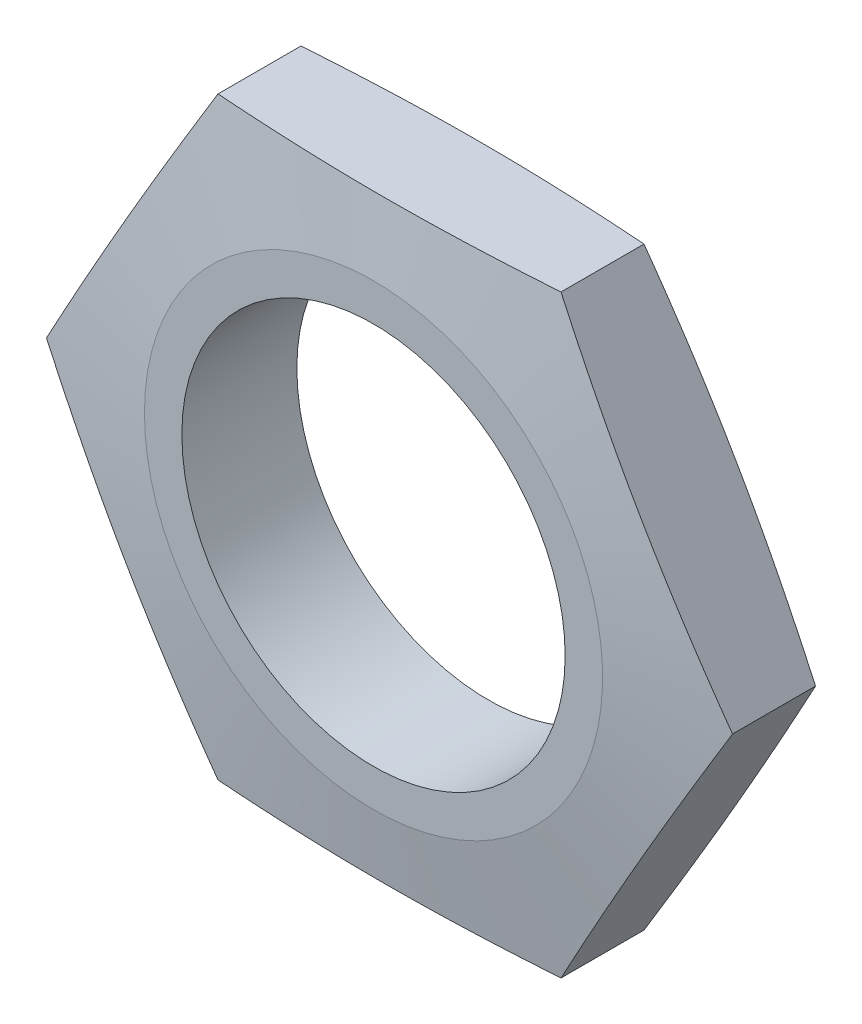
ISO-10303-21;
HEADER;
FILE_DESCRIPTION(('STEP AP214'),'2;1');
FILE_NAME('part.step','',(''),(''),'','','');
FILE_SCHEMA(('AUTOMOTIVE_DESIGN { 1 0 10303 214 1 1 1 1 }'));
ENDSEC;
DATA;
#1=APPLICATION_CONTEXT('core data for automotive mechanical design processes');
#2=APPLICATION_PROTOCOL_DEFINITION('international standard','automotive_design',2000,#1);
#3=PRODUCT_CONTEXT('',#1,'mechanical');
#4=PRODUCT('Part','Part','',(#3));
#5=PRODUCT_RELATED_PRODUCT_CATEGORY('part','',(#4));
#6=PRODUCT_DEFINITION_FORMATION('','',#4);
#7=PRODUCT_DEFINITION_CONTEXT('part definition',#1,'design');
#8=PRODUCT_DEFINITION('design','',#6,#7);
#9=PRODUCT_DEFINITION_SHAPE('','',#8);
#10=(LENGTH_UNIT() NAMED_UNIT(*) SI_UNIT(.MILLI.,.METRE.));
#11=(NAMED_UNIT(*) PLANE_ANGLE_UNIT() SI_UNIT($,.RADIAN.));
#12=(NAMED_UNIT(*) SI_UNIT($,.STERADIAN.) SOLID_ANGLE_UNIT());
#13=UNCERTAINTY_MEASURE_WITH_UNIT(LENGTH_MEASURE(1.E-05),#10,'distance_accuracy_value','');
#14=(GEOMETRIC_REPRESENTATION_CONTEXT(3) GLOBAL_UNCERTAINTY_ASSIGNED_CONTEXT((#13)) GLOBAL_UNIT_ASSIGNED_CONTEXT((#10,
#11,#12)) REPRESENTATION_CONTEXT('',''));
#15=CARTESIAN_POINT('',(0.,0.,0.));
#16=DIRECTION('',(0.,0.,1.));
#17=DIRECTION('',(1.,0.,0.));
#18=AXIS2_PLACEMENT_3D('',#15,#16,#17);
#19=CARTESIAN_POINT('',(-6.81908402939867,-11.811,2.286));
#20=DIRECTION('',(0.,1.,0.));
#21=DIRECTION('',(-1.,0.,0.));
#22=AXIS2_PLACEMENT_3D('',#19,#20,#21);
#23=PLANE('',#22);
#24=CARTESIAN_POINT('',(-17.9839054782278,-11.811,0.543251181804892));
#25=CARTESIAN_POINT('',(-17.4479405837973,-11.811,0.606155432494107));
#26=CARTESIAN_POINT('',(-16.9118795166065,-11.811,0.66825467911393));
#27=CARTESIAN_POINT('',(-15.8395192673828,-11.811,0.790419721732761));
#28=CARTESIAN_POINT('',(-15.303220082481,-11.811,0.850485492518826));
#29=CARTESIAN_POINT('',(-14.2302055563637,-11.811,0.968174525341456));
#30=CARTESIAN_POINT('',(-13.6934901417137,-11.811,1.0257971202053));
#31=CARTESIAN_POINT('',(-12.6197436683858,-11.811,1.13802034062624));
#32=CARTESIAN_POINT('',(-12.0827126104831,-11.811,1.19262097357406));
#33=CARTESIAN_POINT('',(-11.0094197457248,-11.811,1.2979954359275));
#34=CARTESIAN_POINT('',(-10.4731587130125,-11.811,1.34877711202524));
#35=CARTESIAN_POINT('',(-9.40022598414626,-11.811,1.44579113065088));
#36=CARTESIAN_POINT('',(-8.86355429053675,-11.811,1.49202350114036));
#37=CARTESIAN_POINT('',(-7.78977684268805,-11.811,1.57892117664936));
#38=CARTESIAN_POINT('',(-7.25267110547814,-11.811,1.61958669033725));
#39=CARTESIAN_POINT('',(-6.17798771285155,-11.811,1.69418957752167));
#40=CARTESIAN_POINT('',(-5.64041005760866,-11.811,1.72812695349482));
#41=CARTESIAN_POINT('',(-4.56322107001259,-11.811,1.78812640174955));
#42=CARTESIAN_POINT('',(-4.02360841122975,-11.811,1.81416498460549));
#43=CARTESIAN_POINT('',(-2.94401510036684,-11.811,1.85706041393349));
#44=CARTESIAN_POINT('',(-2.40403445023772,-11.811,1.87391730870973));
#45=CARTESIAN_POINT('',(-1.32390944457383,-11.811,1.89756369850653));
#46=CARTESIAN_POINT('',(-0.783765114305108,-11.811,1.90435432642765));
#47=CARTESIAN_POINT('',(0.296554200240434,-11.811,1.90748286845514));
#48=CARTESIAN_POINT('',(0.836729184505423,-11.811,1.90382078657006));
#49=CARTESIAN_POINT('',(1.91744746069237,-11.811,1.8862473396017));
#50=CARTESIAN_POINT('',(2.45799058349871,-11.811,1.87232576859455));
#51=CARTESIAN_POINT('',(3.53874533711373,-11.811,1.83497857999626));
#52=CARTESIAN_POINT('',(4.07895696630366,-11.811,1.81155291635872));
#53=CARTESIAN_POINT('',(5.15902974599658,-11.811,1.75630528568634));
#54=CARTESIAN_POINT('',(5.6988908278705,-11.811,1.72448199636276));
#55=CARTESIAN_POINT('',(6.7781392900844,-11.811,1.65368777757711));
#56=CARTESIAN_POINT('',(7.31752666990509,-11.811,1.61471684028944));
#57=CARTESIAN_POINT('',(8.36923204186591,-11.811,1.53290554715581));
#58=CARTESIAN_POINT('',(8.88157248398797,-11.811,1.49035099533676));
#59=CARTESIAN_POINT('',(9.90586705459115,-11.811,1.40080085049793));
#60=CARTESIAN_POINT('',(10.4178211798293,-11.811,1.3538052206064));
#61=CARTESIAN_POINT('',(11.4413940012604,-11.811,1.25616403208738));
#62=CARTESIAN_POINT('',(11.9530126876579,-11.811,1.20551837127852));
#63=CARTESIAN_POINT('',(12.9759450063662,-11.811,1.10122740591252));
#64=CARTESIAN_POINT('',(13.487258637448,-11.811,1.0475820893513));
#65=CARTESIAN_POINT('',(15.0209069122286,-11.811,0.882963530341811));
#66=CARTESIAN_POINT('',(16.0428469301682,-11.811,0.768317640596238));
#67=CARTESIAN_POINT('',(18.085930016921,-11.811,0.532356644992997));
#68=CARTESIAN_POINT('',(19.1070730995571,-11.811,0.411041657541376));
#69=CARTESIAN_POINT('',(21.1460196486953,-11.811,0.164050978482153));
#70=CARTESIAN_POINT('',(22.1638246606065,-11.811,0.0383880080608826));
#71=CARTESIAN_POINT('',(24.1990173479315,-11.811,-0.216307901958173));
#72=CARTESIAN_POINT('',(25.2164050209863,-11.811,-0.345340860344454));
#73=CARTESIAN_POINT('',(27.2504394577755,-11.811,-0.605835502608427));
#74=CARTESIAN_POINT('',(28.2670863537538,-11.811,-0.737296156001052));
#75=CARTESIAN_POINT('',(30.3001208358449,-11.811,-1.00212800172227));
#76=CARTESIAN_POINT('',(31.3165084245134,-11.811,-1.13549917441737));
#77=CARTESIAN_POINT('',(32.3328063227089,-11.811,-1.26954186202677));
#78=B_SPLINE_CURVE_WITH_KNOTS('',3,(#24,#25,#26,#27,#28,#29,#30,#31,#32,#33,#34,#35,#36,#37,#38,
#39,#40,#41,#42,#43,#44,#45,#46,#47,#48,#49,#50,#51,#52,#53,#54,#55,#56,#57,#58,#59,#60,#61,#62,
#63,#64,#65,#66,#67,#68,#69,#70,#71,#72,#73,#74,#75,#76,#77),.UNSPECIFIED.,.F.,.F.,(4,2,2,2,2,2,
2,2,2,2,2,2,2,2,2,2,2,2,2,2,2,2,2,2,2,2,4),(0.,1.61893298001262,3.2378860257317,4.8572783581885,
6.47666672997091,8.0926313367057,9.70858601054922,11.3244800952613,12.94037358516,
14.5610263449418,16.1816705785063,17.8021324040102,19.4225936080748,21.044668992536,
22.6667522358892,24.2890910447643,25.9114316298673,27.4537228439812,28.9960268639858,
30.5383740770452,32.0807274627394,35.1657416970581,38.2507011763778,41.3272925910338,
44.4039011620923,47.4792325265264,50.5545323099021),.UNSPECIFIED.);
#79=CARTESIAN_POINT('',(-6.81908402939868,-11.811,1.64964364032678));
#80=VERTEX_POINT('',#79);
#81=CARTESIAN_POINT('',(6.81908402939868,-11.811,1.64964364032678));
#82=VERTEX_POINT('',#81);
#83=EDGE_CURVE('E206',#80,#82,#78,.T.);
#84=ORIENTED_EDGE('',*,*,#83,.F.);
#85=DIRECTION('',(0.,0.,-1.));
#86=VECTOR('',#85,1.);
#87=CARTESIAN_POINT('',(-6.81908402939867,-11.811,2.286));
#88=LINE('',#87,#86);
#89=CARTESIAN_POINT('',(-6.81908402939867,-11.811,-1.64964364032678));
#90=VERTEX_POINT('',#89);
#91=EDGE_CURVE('E62',#80,#90,#88,.T.);
#92=ORIENTED_EDGE('',*,*,#91,.T.);
#93=CARTESIAN_POINT('',(-17.9839054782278,-11.811,-0.543251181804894));
#94=CARTESIAN_POINT('',(-17.4479405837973,-11.811,-0.606155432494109));
#95=CARTESIAN_POINT('',(-16.9118795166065,-11.811,-0.668254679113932));
#96=CARTESIAN_POINT('',(-15.8395192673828,-11.811,-0.790419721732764));
#97=CARTESIAN_POINT('',(-15.303220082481,-11.811,-0.850485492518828));
#98=CARTESIAN_POINT('',(-14.2302055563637,-11.811,-0.968174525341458));
#99=CARTESIAN_POINT('',(-13.6934901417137,-11.811,-1.02579712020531));
#100=CARTESIAN_POINT('',(-12.6197436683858,-11.811,-1.13802034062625));
#101=CARTESIAN_POINT('',(-12.0827126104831,-11.811,-1.19262097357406));
#102=CARTESIAN_POINT('',(-11.0094197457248,-11.811,-1.2979954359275));
#103=CARTESIAN_POINT('',(-10.4731587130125,-11.811,-1.34877711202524));
#104=CARTESIAN_POINT('',(-9.40022598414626,-11.811,-1.44579113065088));
#105=CARTESIAN_POINT('',(-8.86355429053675,-11.811,-1.49202350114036));
#106=CARTESIAN_POINT('',(-7.78977684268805,-11.811,-1.57892117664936));
#107=CARTESIAN_POINT('',(-7.25267110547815,-11.811,-1.61958669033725));
#108=CARTESIAN_POINT('',(-6.17798771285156,-11.811,-1.69418957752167));
#109=CARTESIAN_POINT('',(-5.64041005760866,-11.811,-1.72812695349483));
#110=CARTESIAN_POINT('',(-4.56322107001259,-11.811,-1.78812640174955));
#111=CARTESIAN_POINT('',(-4.02360841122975,-11.811,-1.81416498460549));
#112=CARTESIAN_POINT('',(-2.94401510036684,-11.811,-1.85706041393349));
#113=CARTESIAN_POINT('',(-2.40403445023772,-11.811,-1.87391730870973));
#114=CARTESIAN_POINT('',(-1.32390944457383,-11.811,-1.89756369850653));
#115=CARTESIAN_POINT('',(-0.783765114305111,-11.811,-1.90435432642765));
#116=CARTESIAN_POINT('',(0.29655420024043,-11.811,-1.90748286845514));
#117=CARTESIAN_POINT('',(0.836729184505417,-11.811,-1.90382078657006));
#118=CARTESIAN_POINT('',(1.91744746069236,-11.811,-1.8862473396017));
#119=CARTESIAN_POINT('',(2.4579905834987,-11.811,-1.87232576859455));
#120=CARTESIAN_POINT('',(3.53874533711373,-11.811,-1.83497857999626));
#121=CARTESIAN_POINT('',(4.07895696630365,-11.811,-1.81155291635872));
#122=CARTESIAN_POINT('',(5.15902974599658,-11.811,-1.75630528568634));
#123=CARTESIAN_POINT('',(5.6988908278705,-11.811,-1.72448199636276));
#124=CARTESIAN_POINT('',(6.7781392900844,-11.811,-1.65368777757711));
#125=CARTESIAN_POINT('',(7.31752666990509,-11.811,-1.61471684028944));
#126=CARTESIAN_POINT('',(8.36923204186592,-11.811,-1.53290554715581));
#127=CARTESIAN_POINT('',(8.88157248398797,-11.811,-1.49035099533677));
#128=CARTESIAN_POINT('',(9.90586705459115,-11.811,-1.40080085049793));
#129=CARTESIAN_POINT('',(10.4178211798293,-11.811,-1.35380522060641));
#130=CARTESIAN_POINT('',(11.4413940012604,-11.811,-1.25616403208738));
#131=CARTESIAN_POINT('',(11.9530126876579,-11.811,-1.20551837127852));
#132=CARTESIAN_POINT('',(12.9759450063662,-11.811,-1.10122740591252));
#133=CARTESIAN_POINT('',(13.487258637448,-11.811,-1.0475820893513));
#134=CARTESIAN_POINT('',(15.0209069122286,-11.811,-0.882963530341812));
#135=CARTESIAN_POINT('',(16.0428469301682,-11.811,-0.768317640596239));
#136=CARTESIAN_POINT('',(18.085930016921,-11.811,-0.532356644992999));
#137=CARTESIAN_POINT('',(19.1070730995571,-11.811,-0.411041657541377));
#138=CARTESIAN_POINT('',(21.1460196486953,-11.811,-0.164050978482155));
#139=CARTESIAN_POINT('',(22.1638246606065,-11.811,-0.0383880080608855));
#140=CARTESIAN_POINT('',(24.1990173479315,-11.811,0.216307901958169));
#141=CARTESIAN_POINT('',(25.2164050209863,-11.811,0.34534086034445));
#142=CARTESIAN_POINT('',(27.2504394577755,-11.811,0.605835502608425));
#143=CARTESIAN_POINT('',(28.2670863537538,-11.811,0.73729615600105));
#144=CARTESIAN_POINT('',(30.3001208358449,-11.811,1.00212800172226));
#145=CARTESIAN_POINT('',(31.3165084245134,-11.811,1.13549917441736));
#146=CARTESIAN_POINT('',(32.3328063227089,-11.811,1.26954186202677));
#147=B_SPLINE_CURVE_WITH_KNOTS('',3,(#93,#94,#95,#96,#97,#98,#99,#100,#101,#102,#103,#104,#105,
#106,#107,#108,#109,#110,#111,#112,#113,#114,#115,#116,#117,#118,#119,#120,#121,#122,#123,#124,
#125,#126,#127,#128,#129,#130,#131,#132,#133,#134,#135,#136,#137,#138,#139,#140,#141,#142,#143,
#144,#145,#146),.UNSPECIFIED.,.F.,.F.,(4,2,2,2,2,2,2,2,2,2,2,2,2,2,2,2,2,2,2,2,2,2,2,2,2,2,4),
(0.,1.61893298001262,3.23788602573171,4.8572783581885,6.47666672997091,8.0926313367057,
9.70858601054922,11.3244800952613,12.94037358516,14.5610263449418,16.1816705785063,
17.8021324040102,19.4225936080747,21.044668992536,22.6667522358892,24.2890910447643,
25.9114316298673,27.4537228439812,28.9960268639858,30.5383740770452,32.0807274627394,
35.1657416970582,38.2507011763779,41.3272925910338,44.4039011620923,47.4792325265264,
50.5545323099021),.UNSPECIFIED.);
#148=CARTESIAN_POINT('',(6.81908402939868,-11.811,-1.64964364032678));
#149=VERTEX_POINT('',#148);
#150=EDGE_CURVE('E132',#149,#90,#147,.F.);
#151=ORIENTED_EDGE('',*,*,#150,.F.);
#152=DIRECTION('',(0.,0.,-1.));
#153=VECTOR('',#152,1.);
#154=CARTESIAN_POINT('',(6.81908402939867,-11.811,2.286));
#155=LINE('',#154,#153);
#156=EDGE_CURVE('E47',#82,#149,#155,.T.);
#157=ORIENTED_EDGE('',*,*,#156,.F.);
#158=EDGE_LOOP('',(#84,#92,#151,#157));
#159=FACE_BOUND('',#158,.T.);
#160=ADVANCED_FACE('F33',(#159),#23,.F.);
#161=CARTESIAN_POINT('',(6.81908402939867,-11.811,2.286));
#162=DIRECTION('',(-0.866025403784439,0.5,0.));
#163=DIRECTION('',(-0.5,-0.866025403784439,0.));
#164=AXIS2_PLACEMENT_3D('',#161,#162,#163);
#165=PLANE('',#164);
#166=CARTESIAN_POINT('',(6.81896855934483,-11.8112,1.64962742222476));
#167=CARTESIAN_POINT('',(7.10284384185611,-11.3195135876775,1.68951553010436));
#168=CARTESIAN_POINT('',(7.38686229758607,-10.827579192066,1.72566335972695));
#169=CARTESIAN_POINT('',(7.95517530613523,-9.84323218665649,1.7890958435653));
#170=CARTESIAN_POINT('',(8.239469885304,-9.35081953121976,1.81637954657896));
#171=CARTESIAN_POINT('',(8.80785826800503,-8.36634197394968,1.86066039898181));
#172=CARTESIAN_POINT('',(9.0919517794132,-7.87427757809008,1.87767216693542));
#173=CARTESIAN_POINT('',(9.66023887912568,-6.88997544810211,1.90047738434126));
#174=CARTESIAN_POINT('',(9.94443246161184,-6.39773772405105,1.90627140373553));
#175=CARTESIAN_POINT('',(10.5128196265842,-5.41326227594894,1.90627140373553));
#176=CARTESIAN_POINT('',(10.7970132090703,-4.92102455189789,1.90047738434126));
#177=CARTESIAN_POINT('',(11.3653003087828,-3.93672242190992,1.87767216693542));
#178=CARTESIAN_POINT('',(11.649393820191,-3.44465802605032,1.86066039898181));
#179=CARTESIAN_POINT('',(12.217782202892,-2.46018046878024,1.81637954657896));
#180=CARTESIAN_POINT('',(12.5020767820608,-1.96776781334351,1.7890958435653));
#181=CARTESIAN_POINT('',(13.0703897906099,-0.983420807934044,1.72566335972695));
#182=CARTESIAN_POINT('',(13.3544082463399,-0.491486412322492,1.68951553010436));
#183=CARTESIAN_POINT('',(13.6382835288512,0.000200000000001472,1.64962742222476));
#184=B_SPLINE_CURVE_WITH_KNOTS('',3,(#166,#167,#168,#169,#170,#171,#172,#173,#174,#175,#176,
#177,#178,#179,#180,#181,#182,#183),.UNSPECIFIED.,.F.,.F.,(4,2,2,2,2,2,2,2,4),(0.,
1.70747320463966,3.41512957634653,5.12034992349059,6.82548363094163,8.53061733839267,
10.2358376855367,11.9434940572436,13.6509672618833),.UNSPECIFIED.);
#185=CARTESIAN_POINT('',(13.6381680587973,0.,1.64964364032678));
#186=VERTEX_POINT('',#185);
#187=EDGE_CURVE('E128',#82,#186,#184,.T.);
#188=ORIENTED_EDGE('',*,*,#187,.F.);
#189=ORIENTED_EDGE('',*,*,#156,.T.);
#190=CARTESIAN_POINT('',(13.6382835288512,0.000200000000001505,-1.64962742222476));
#191=CARTESIAN_POINT('',(13.3544082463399,-0.491486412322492,-1.68951553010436));
#192=CARTESIAN_POINT('',(13.0703897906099,-0.983420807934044,-1.72566335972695));
#193=CARTESIAN_POINT('',(12.5020767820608,-1.96776781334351,-1.7890958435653));
#194=CARTESIAN_POINT('',(12.217782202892,-2.46018046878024,-1.81637954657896));
#195=CARTESIAN_POINT('',(11.649393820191,-3.44465802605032,-1.86066039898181));
#196=CARTESIAN_POINT('',(11.3653003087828,-3.93672242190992,-1.87767216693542));
#197=CARTESIAN_POINT('',(10.7970132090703,-4.92102455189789,-1.90047738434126));
#198=CARTESIAN_POINT('',(10.5128196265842,-5.41326227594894,-1.90627140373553));
#199=CARTESIAN_POINT('',(9.94443246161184,-6.39773772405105,-1.90627140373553));
#200=CARTESIAN_POINT('',(9.66023887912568,-6.88997544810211,-1.90047738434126));
#201=CARTESIAN_POINT('',(9.0919517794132,-7.87427757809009,-1.87767216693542));
#202=CARTESIAN_POINT('',(8.80785826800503,-8.36634197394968,-1.86066039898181));
#203=CARTESIAN_POINT('',(8.239469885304,-9.35081953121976,-1.81637954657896));
#204=CARTESIAN_POINT('',(7.95517530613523,-9.8432321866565,-1.7890958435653));
#205=CARTESIAN_POINT('',(7.38686229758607,-10.827579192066,-1.72566335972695));
#206=CARTESIAN_POINT('',(7.10284384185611,-11.3195135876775,-1.68951553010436));
#207=CARTESIAN_POINT('',(6.81896855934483,-11.8112,-1.64962742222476));
#208=B_SPLINE_CURVE_WITH_KNOTS('',3,(#190,#191,#192,#193,#194,#195,#196,#197,#198,#199,#200,
#201,#202,#203,#204,#205,#206,#207),.UNSPECIFIED.,.F.,.F.,(4,2,2,2,2,2,2,2,4),(0.,
1.70747320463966,3.41512957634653,5.12034992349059,6.82548363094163,8.53061733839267,
10.2358376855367,11.9434940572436,13.6509672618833),.UNSPECIFIED.);
#209=CARTESIAN_POINT('',(13.6381680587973,0.,-1.64964364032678));
#210=VERTEX_POINT('',#209);
#211=EDGE_CURVE('E127',#210,#149,#208,.T.);
#212=ORIENTED_EDGE('',*,*,#211,.F.);
#213=DIRECTION('',(0.,0.,-1.));
#214=VECTOR('',#213,1.);
#215=CARTESIAN_POINT('',(13.6381680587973,0.,2.286));
#216=LINE('',#215,#214);
#217=EDGE_CURVE('E115',#186,#210,#216,.T.);
#218=ORIENTED_EDGE('',*,*,#217,.F.);
#219=EDGE_LOOP('',(#188,#189,#212,#218));
#220=FACE_BOUND('',#219,.T.);
#221=ADVANCED_FACE('F125',(#220),#165,.F.);
#222=CARTESIAN_POINT('',(13.6381680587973,0.,2.286));
#223=DIRECTION('',(-0.866025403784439,-0.5,0.));
#224=DIRECTION('',(0.5,-0.866025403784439,0.));
#225=AXIS2_PLACEMENT_3D('',#222,#223,#224);
#226=PLANE('',#225);
#227=CARTESIAN_POINT('',(13.6382835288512,-0.000199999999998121,1.64962742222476));
#228=CARTESIAN_POINT('',(13.3544082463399,0.491486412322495,1.68951553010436));
#229=CARTESIAN_POINT('',(13.0703897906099,0.983420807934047,1.72566335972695));
#230=CARTESIAN_POINT('',(12.5020767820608,1.96776781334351,1.7890958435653));
#231=CARTESIAN_POINT('',(12.217782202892,2.46018046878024,1.81637954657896));
#232=CARTESIAN_POINT('',(11.649393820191,3.44465802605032,1.86066039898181));
#233=CARTESIAN_POINT('',(11.3653003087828,3.93672242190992,1.87767216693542));
#234=CARTESIAN_POINT('',(10.7970132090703,4.92102455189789,1.90047738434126));
#235=CARTESIAN_POINT('',(10.5128196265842,5.41326227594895,1.90627140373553));
#236=CARTESIAN_POINT('',(9.94443246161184,6.39773772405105,1.90627140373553));
#237=CARTESIAN_POINT('',(9.66023887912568,6.88997544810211,1.90047738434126));
#238=CARTESIAN_POINT('',(9.0919517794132,7.87427757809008,1.87767216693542));
#239=CARTESIAN_POINT('',(8.80785826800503,8.36634197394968,1.86066039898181));
#240=CARTESIAN_POINT('',(8.239469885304,9.35081953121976,1.81637954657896));
#241=CARTESIAN_POINT('',(7.95517530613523,9.84323218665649,1.7890958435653));
#242=CARTESIAN_POINT('',(7.38686229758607,10.827579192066,1.72566335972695));
#243=CARTESIAN_POINT('',(7.10284384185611,11.3195135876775,1.68951553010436));
#244=CARTESIAN_POINT('',(6.81896855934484,11.8112,1.64962742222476));
#245=B_SPLINE_CURVE_WITH_KNOTS('',3,(#227,#228,#229,#230,#231,#232,#233,#234,#235,#236,#237,
#238,#239,#240,#241,#242,#243,#244),.UNSPECIFIED.,.F.,.F.,(4,2,2,2,2,2,2,2,4),(0.,
1.70747320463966,3.41512957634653,5.12034992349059,6.82548363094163,8.53061733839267,
10.2358376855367,11.9434940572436,13.6509672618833),.UNSPECIFIED.);
#246=CARTESIAN_POINT('',(6.81908402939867,11.811,1.64964364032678));
#247=VERTEX_POINT('',#246);
#248=EDGE_CURVE('E95',#186,#247,#245,.T.);
#249=ORIENTED_EDGE('',*,*,#248,.F.);
#250=ORIENTED_EDGE('',*,*,#217,.T.);
#251=CARTESIAN_POINT('',(6.81896855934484,11.8112,-1.64962742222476));
#252=CARTESIAN_POINT('',(7.10284384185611,11.3195135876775,-1.68951553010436));
#253=CARTESIAN_POINT('',(7.38686229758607,10.827579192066,-1.72566335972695));
#254=CARTESIAN_POINT('',(7.95517530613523,9.84323218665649,-1.7890958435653));
#255=CARTESIAN_POINT('',(8.239469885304,9.35081953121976,-1.81637954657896));
#256=CARTESIAN_POINT('',(8.80785826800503,8.36634197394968,-1.86066039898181));
#257=CARTESIAN_POINT('',(9.0919517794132,7.87427757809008,-1.87767216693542));
#258=CARTESIAN_POINT('',(9.66023887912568,6.88997544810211,-1.90047738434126));
#259=CARTESIAN_POINT('',(9.94443246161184,6.39773772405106,-1.90627140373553));
#260=CARTESIAN_POINT('',(10.5128196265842,5.41326227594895,-1.90627140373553));
#261=CARTESIAN_POINT('',(10.7970132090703,4.92102455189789,-1.90047738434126));
#262=CARTESIAN_POINT('',(11.3653003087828,3.93672242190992,-1.87767216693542));
#263=CARTESIAN_POINT('',(11.649393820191,3.44465802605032,-1.86066039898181));
#264=CARTESIAN_POINT('',(12.217782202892,2.46018046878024,-1.81637954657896));
#265=CARTESIAN_POINT('',(12.5020767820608,1.96776781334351,-1.7890958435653));
#266=CARTESIAN_POINT('',(13.0703897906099,0.983420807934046,-1.72566335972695));
#267=CARTESIAN_POINT('',(13.3544082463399,0.491486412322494,-1.68951553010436));
#268=CARTESIAN_POINT('',(13.6382835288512,-0.000199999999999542,-1.64962742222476));
#269=B_SPLINE_CURVE_WITH_KNOTS('',3,(#251,#252,#253,#254,#255,#256,#257,#258,#259,#260,#261,
#262,#263,#264,#265,#266,#267,#268),.UNSPECIFIED.,.F.,.F.,(4,2,2,2,2,2,2,2,4),(0.,
1.70747320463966,3.41512957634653,5.12034992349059,6.82548363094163,8.53061733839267,
10.2358376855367,11.9434940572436,13.6509672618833),.UNSPECIFIED.);
#270=CARTESIAN_POINT('',(6.81908402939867,11.811,-1.64964364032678));
#271=VERTEX_POINT('',#270);
#272=EDGE_CURVE('E135',#271,#210,#269,.T.);
#273=ORIENTED_EDGE('',*,*,#272,.F.);
#274=DIRECTION('',(0.,0.,-1.));
#275=VECTOR('',#274,1.);
#276=CARTESIAN_POINT('',(6.81908402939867,11.811,2.286));
#277=LINE('',#276,#275);
#278=EDGE_CURVE('E113',#247,#271,#277,.T.);
#279=ORIENTED_EDGE('',*,*,#278,.F.);
#280=EDGE_LOOP('',(#249,#250,#273,#279));
#281=FACE_BOUND('',#280,.T.);
#282=ADVANCED_FACE('F184',(#281),#226,.F.);
#283=CARTESIAN_POINT('',(6.81908402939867,11.811,2.286));
#284=DIRECTION('',(0.,-1.,0.));
#285=DIRECTION('',(0.,0.,-1.));
#286=AXIS2_PLACEMENT_3D('',#283,#284,#285);
#287=PLANE('',#286);
#288=CARTESIAN_POINT('',(-17.9839054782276,11.811,0.543251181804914));
#289=CARTESIAN_POINT('',(-17.4479405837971,11.811,0.606155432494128));
#290=CARTESIAN_POINT('',(-16.9118795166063,11.811,0.668254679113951));
#291=CARTESIAN_POINT('',(-15.8395192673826,11.811,0.790419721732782));
#292=CARTESIAN_POINT('',(-15.3032200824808,11.811,0.850485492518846));
#293=CARTESIAN_POINT('',(-14.2302055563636,11.811,0.968174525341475));
#294=CARTESIAN_POINT('',(-13.6934901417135,11.811,1.02579712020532));
#295=CARTESIAN_POINT('',(-12.6197436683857,11.811,1.13802034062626));
#296=CARTESIAN_POINT('',(-12.082712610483,11.811,1.19262097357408));
#297=CARTESIAN_POINT('',(-11.0094197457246,11.811,1.29799543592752));
#298=CARTESIAN_POINT('',(-10.4731587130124,11.811,1.34877711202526));
#299=CARTESIAN_POINT('',(-9.40022598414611,11.811,1.44579113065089));
#300=CARTESIAN_POINT('',(-8.8635542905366,11.811,1.49202350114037));
#301=CARTESIAN_POINT('',(-7.78977684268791,11.811,1.57892117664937));
#302=CARTESIAN_POINT('',(-7.252671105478,11.811,1.61958669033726));
#303=CARTESIAN_POINT('',(-6.17798771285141,11.811,1.69418957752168));
#304=CARTESIAN_POINT('',(-5.64041005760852,11.811,1.72812695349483));
#305=CARTESIAN_POINT('',(-4.56322107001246,11.811,1.78812640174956));
#306=CARTESIAN_POINT('',(-4.02360841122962,11.811,1.8141649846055));
#307=CARTESIAN_POINT('',(-2.94401510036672,11.811,1.85706041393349));
#308=CARTESIAN_POINT('',(-2.4040344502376,11.811,1.87391730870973));
#309=CARTESIAN_POINT('',(-1.32390944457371,11.811,1.89756369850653));
#310=CARTESIAN_POINT('',(-0.783765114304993,11.811,1.90435432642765));
#311=CARTESIAN_POINT('',(0.296554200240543,11.811,1.90748286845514));
#312=CARTESIAN_POINT('',(0.836729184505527,11.811,1.90382078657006));
#313=CARTESIAN_POINT('',(1.91744746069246,11.811,1.8862473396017));
#314=CARTESIAN_POINT('',(2.45799058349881,11.811,1.87232576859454));
#315=CARTESIAN_POINT('',(3.53874533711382,11.811,1.83497857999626));
#316=CARTESIAN_POINT('',(4.07895696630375,11.811,1.81155291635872));
#317=CARTESIAN_POINT('',(5.15902974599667,11.811,1.75630528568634));
#318=CARTESIAN_POINT('',(5.69889082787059,11.811,1.72448199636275));
#319=CARTESIAN_POINT('',(6.77813929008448,11.811,1.6536877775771));
#320=CARTESIAN_POINT('',(7.31752666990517,11.811,1.61471684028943));
#321=CARTESIAN_POINT('',(8.36923204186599,11.811,1.53290554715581));
#322=CARTESIAN_POINT('',(8.88157248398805,11.811,1.49035099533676));
#323=CARTESIAN_POINT('',(9.90586705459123,11.811,1.40080085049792));
#324=CARTESIAN_POINT('',(10.4178211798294,11.811,1.3538052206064));
#325=CARTESIAN_POINT('',(11.4413940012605,11.811,1.25616403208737));
#326=CARTESIAN_POINT('',(11.953012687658,11.811,1.20551837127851));
#327=CARTESIAN_POINT('',(12.9759450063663,11.811,1.10122740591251));
#328=CARTESIAN_POINT('',(13.4872586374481,11.811,1.04758208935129));
#329=CARTESIAN_POINT('',(15.0209069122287,11.811,0.8829635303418));
#330=CARTESIAN_POINT('',(16.0428469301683,11.811,0.768317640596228));
#331=CARTESIAN_POINT('',(18.0859300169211,11.811,0.532356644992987));
#332=CARTESIAN_POINT('',(19.1070730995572,11.811,0.411041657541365));
#333=CARTESIAN_POINT('',(21.1460196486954,11.811,0.164050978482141));
#334=CARTESIAN_POINT('',(22.1638246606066,11.811,0.0383880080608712));
#335=CARTESIAN_POINT('',(24.1990173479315,11.811,-0.216307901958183));
#336=CARTESIAN_POINT('',(25.2164050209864,11.811,-0.345340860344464));
#337=CARTESIAN_POINT('',(27.2504394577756,11.811,-0.605835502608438));
#338=CARTESIAN_POINT('',(28.2670863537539,11.811,-0.737296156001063));
#339=CARTESIAN_POINT('',(30.300120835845,11.811,-1.00212800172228));
#340=CARTESIAN_POINT('',(31.3165084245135,11.811,-1.13549917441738));
#341=CARTESIAN_POINT('',(32.332806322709,11.811,-1.26954186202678));
#342=B_SPLINE_CURVE_WITH_KNOTS('',3,(#288,#289,#290,#291,#292,#293,#294,#295,#296,#297,#298,
#299,#300,#301,#302,#303,#304,#305,#306,#307,#308,#309,#310,#311,#312,#313,#314,#315,#316,#317,
#318,#319,#320,#321,#322,#323,#324,#325,#326,#327,#328,#329,#330,#331,#332,#333,#334,#335,#336,
#337,#338,#339,#340,#341),.UNSPECIFIED.,.F.,.F.,(4,2,2,2,2,2,2,2,2,2,2,2,2,2,2,2,2,2,2,2,2,2,2,
2,2,2,4),(0.,1.61893298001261,3.23788602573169,4.85727835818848,6.47666672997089,
8.09263133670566,9.70858601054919,11.3244800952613,12.9403735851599,14.5610263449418,
16.1816705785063,17.8021324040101,19.4225936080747,21.0446689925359,22.6667522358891,
24.2890910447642,25.9114316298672,27.4537228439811,28.9960268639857,30.5383740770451,
32.0807274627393,35.1657416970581,38.2507011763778,41.3272925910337,44.4039011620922,
47.4792325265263,50.554532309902),.UNSPECIFIED.);
#343=CARTESIAN_POINT('',(-6.81908402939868,11.811,1.64964364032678));
#344=VERTEX_POINT('',#343);
#345=EDGE_CURVE('E92',#247,#344,#342,.F.);
#346=ORIENTED_EDGE('',*,*,#345,.F.);
#347=ORIENTED_EDGE('',*,*,#278,.T.);
#348=CARTESIAN_POINT('',(-17.9839054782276,11.811,-0.543251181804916));
#349=CARTESIAN_POINT('',(-17.4479405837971,11.811,-0.60615543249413));
#350=CARTESIAN_POINT('',(-16.9118795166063,11.811,-0.668254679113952));
#351=CARTESIAN_POINT('',(-15.8395192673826,11.811,-0.790419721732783));
#352=CARTESIAN_POINT('',(-15.3032200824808,11.811,-0.850485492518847));
#353=CARTESIAN_POINT('',(-14.2302055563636,11.811,-0.968174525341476));
#354=CARTESIAN_POINT('',(-13.6934901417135,11.811,-1.02579712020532));
#355=CARTESIAN_POINT('',(-12.6197436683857,11.811,-1.13802034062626));
#356=CARTESIAN_POINT('',(-12.082712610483,11.811,-1.19262097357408));
#357=CARTESIAN_POINT('',(-11.0094197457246,11.811,-1.29799543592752));
#358=CARTESIAN_POINT('',(-10.4731587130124,11.811,-1.34877711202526));
#359=CARTESIAN_POINT('',(-9.40022598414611,11.811,-1.44579113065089));
#360=CARTESIAN_POINT('',(-8.86355429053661,11.811,-1.49202350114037));
#361=CARTESIAN_POINT('',(-7.78977684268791,11.811,-1.57892117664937));
#362=CARTESIAN_POINT('',(-7.252671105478,11.811,-1.61958669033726));
#363=CARTESIAN_POINT('',(-6.17798771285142,11.811,-1.69418957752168));
#364=CARTESIAN_POINT('',(-5.64041005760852,11.811,-1.72812695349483));
#365=CARTESIAN_POINT('',(-4.56322107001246,11.811,-1.78812640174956));
#366=CARTESIAN_POINT('',(-4.02360841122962,11.811,-1.8141649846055));
#367=CARTESIAN_POINT('',(-2.94401510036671,11.811,-1.85706041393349));
#368=CARTESIAN_POINT('',(-2.40403445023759,11.811,-1.87391730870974));
#369=CARTESIAN_POINT('',(-1.32390944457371,11.811,-1.89756369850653));
#370=CARTESIAN_POINT('',(-0.78376511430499,11.811,-1.90435432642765));
#371=CARTESIAN_POINT('',(0.296554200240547,11.811,-1.90748286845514));
#372=CARTESIAN_POINT('',(0.836729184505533,11.811,-1.90382078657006));
#373=CARTESIAN_POINT('',(1.91744746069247,11.811,-1.8862473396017));
#374=CARTESIAN_POINT('',(2.45799058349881,11.811,-1.87232576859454));
#375=CARTESIAN_POINT('',(3.53874533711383,11.811,-1.83497857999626));
#376=CARTESIAN_POINT('',(4.07895696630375,11.811,-1.81155291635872));
#377=CARTESIAN_POINT('',(5.15902974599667,11.811,-1.75630528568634));
#378=CARTESIAN_POINT('',(5.69889082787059,11.811,-1.72448199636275));
#379=CARTESIAN_POINT('',(6.77813929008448,11.811,-1.6536877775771));
#380=CARTESIAN_POINT('',(7.31752666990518,11.811,-1.61471684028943));
#381=CARTESIAN_POINT('',(8.369232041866,11.811,-1.53290554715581));
#382=CARTESIAN_POINT('',(8.88157248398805,11.811,-1.49035099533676));
#383=CARTESIAN_POINT('',(9.90586705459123,11.811,-1.40080085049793));
#384=CARTESIAN_POINT('',(10.4178211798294,11.811,-1.3538052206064));
#385=CARTESIAN_POINT('',(11.4413940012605,11.811,-1.25616403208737));
#386=CARTESIAN_POINT('',(11.953012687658,11.811,-1.20551837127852));
#387=CARTESIAN_POINT('',(12.9759450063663,11.811,-1.10122740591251));
#388=CARTESIAN_POINT('',(13.4872586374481,11.811,-1.04758208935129));
#389=CARTESIAN_POINT('',(15.0209069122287,11.811,-0.882963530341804));
#390=CARTESIAN_POINT('',(16.0428469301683,11.811,-0.768317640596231));
#391=CARTESIAN_POINT('',(18.0859300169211,11.811,-0.532356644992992));
#392=CARTESIAN_POINT('',(19.1070730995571,11.811,-0.41104165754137));
#393=CARTESIAN_POINT('',(21.1460196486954,11.811,-0.164050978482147));
#394=CARTESIAN_POINT('',(22.1638246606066,11.811,-0.0383880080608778));
#395=CARTESIAN_POINT('',(24.1990173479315,11.811,0.216307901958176));
#396=CARTESIAN_POINT('',(25.2164050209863,11.811,0.345340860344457));
#397=CARTESIAN_POINT('',(27.2504394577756,11.811,0.605835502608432));
#398=CARTESIAN_POINT('',(28.2670863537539,11.811,0.737296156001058));
#399=CARTESIAN_POINT('',(30.300120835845,11.811,1.00212800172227));
#400=CARTESIAN_POINT('',(31.3165084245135,11.811,1.13549917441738));
#401=CARTESIAN_POINT('',(32.332806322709,11.811,1.26954186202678));
#402=B_SPLINE_CURVE_WITH_KNOTS('',3,(#348,#349,#350,#351,#352,#353,#354,#355,#356,#357,#358,
#359,#360,#361,#362,#363,#364,#365,#366,#367,#368,#369,#370,#371,#372,#373,#374,#375,#376,#377,
#378,#379,#380,#381,#382,#383,#384,#385,#386,#387,#388,#389,#390,#391,#392,#393,#394,#395,#396,
#397,#398,#399,#400,#401),.UNSPECIFIED.,.F.,.F.,(4,2,2,2,2,2,2,2,2,2,2,2,2,2,2,2,2,2,2,2,2,2,2,
2,2,2,4),(0.,1.61893298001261,3.23788602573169,4.85727835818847,6.47666672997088,
8.09263133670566,9.70858601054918,11.3244800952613,12.9403735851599,14.5610263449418,
16.1816705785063,17.8021324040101,19.4225936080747,21.0446689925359,22.6667522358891,
24.2890910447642,25.9114316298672,27.4537228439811,28.9960268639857,30.5383740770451,
32.0807274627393,35.165741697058,38.2507011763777,41.3272925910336,44.4039011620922,
47.4792325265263,50.554532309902),.UNSPECIFIED.);
#403=CARTESIAN_POINT('',(-6.81908402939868,11.811,-1.64964364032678));
#404=VERTEX_POINT('',#403);
#405=EDGE_CURVE('E112',#404,#271,#402,.T.);
#406=ORIENTED_EDGE('',*,*,#405,.F.);
#407=DIRECTION('',(0.,0.,-1.));
#408=VECTOR('',#407,1.);
#409=CARTESIAN_POINT('',(-6.81908402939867,11.811,2.286));
#410=LINE('',#409,#408);
#411=EDGE_CURVE('E104',#344,#404,#410,.T.);
#412=ORIENTED_EDGE('',*,*,#411,.F.);
#413=EDGE_LOOP('',(#346,#347,#406,#412));
#414=FACE_BOUND('',#413,.T.);
#415=ADVANCED_FACE('F110',(#414),#287,.F.);
#416=CARTESIAN_POINT('',(-6.81908402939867,11.811,2.286));
#417=DIRECTION('',(0.866025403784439,-0.5,0.));
#418=DIRECTION('',(0.5,0.866025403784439,0.));
#419=AXIS2_PLACEMENT_3D('',#416,#417,#418);
#420=PLANE('',#419);
#421=CARTESIAN_POINT('',(-6.81896855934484,11.8112,1.64962742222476));
#422=CARTESIAN_POINT('',(-7.10284384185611,11.3195135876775,1.68951553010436));
#423=CARTESIAN_POINT('',(-7.38686229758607,10.827579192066,1.72566335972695));
#424=CARTESIAN_POINT('',(-7.95517530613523,9.8432321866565,1.7890958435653));
#425=CARTESIAN_POINT('',(-8.239469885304,9.35081953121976,1.81637954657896));
#426=CARTESIAN_POINT('',(-8.80785826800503,8.36634197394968,1.86066039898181));
#427=CARTESIAN_POINT('',(-9.0919517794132,7.87427757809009,1.87767216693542));
#428=CARTESIAN_POINT('',(-9.66023887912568,6.88997544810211,1.90047738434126));
#429=CARTESIAN_POINT('',(-9.94443246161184,6.39773772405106,1.90627140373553));
#430=CARTESIAN_POINT('',(-10.5128196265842,5.41326227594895,1.90627140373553));
#431=CARTESIAN_POINT('',(-10.7970132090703,4.92102455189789,1.90047738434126));
#432=CARTESIAN_POINT('',(-11.3653003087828,3.93672242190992,1.87767216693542));
#433=CARTESIAN_POINT('',(-11.649393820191,3.44465802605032,1.86066039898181));
#434=CARTESIAN_POINT('',(-12.217782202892,2.46018046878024,1.81637954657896));
#435=CARTESIAN_POINT('',(-12.5020767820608,1.96776781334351,1.7890958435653));
#436=CARTESIAN_POINT('',(-13.0703897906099,0.983420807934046,1.72566335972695));
#437=CARTESIAN_POINT('',(-13.3544082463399,0.491486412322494,1.68951553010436));
#438=CARTESIAN_POINT('',(-13.6382835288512,-0.000199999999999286,1.64962742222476));
#439=B_SPLINE_CURVE_WITH_KNOTS('',3,(#421,#422,#423,#424,#425,#426,#427,#428,#429,#430,#431,
#432,#433,#434,#435,#436,#437,#438),.UNSPECIFIED.,.F.,.F.,(4,2,2,2,2,2,2,2,4),(0.,
1.70747320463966,3.41512957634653,5.12034992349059,6.82548363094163,8.53061733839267,
10.2358376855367,11.9434940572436,13.6509672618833),.UNSPECIFIED.);
#440=CARTESIAN_POINT('',(-13.6381680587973,0.,1.64964364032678));
#441=VERTEX_POINT('',#440);
#442=EDGE_CURVE('E54',#344,#441,#439,.T.);
#443=ORIENTED_EDGE('',*,*,#442,.F.);
#444=ORIENTED_EDGE('',*,*,#411,.T.);
#445=CARTESIAN_POINT('',(-13.6382835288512,-0.000199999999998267,-1.64962742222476));
#446=CARTESIAN_POINT('',(-13.3544082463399,0.491486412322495,-1.68951553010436));
#447=CARTESIAN_POINT('',(-13.0703897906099,0.983420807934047,-1.72566335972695));
#448=CARTESIAN_POINT('',(-12.5020767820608,1.96776781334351,-1.7890958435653));
#449=CARTESIAN_POINT('',(-12.217782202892,2.46018046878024,-1.81637954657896));
#450=CARTESIAN_POINT('',(-11.649393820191,3.44465802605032,-1.86066039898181));
#451=CARTESIAN_POINT('',(-11.3653003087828,3.93672242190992,-1.87767216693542));
#452=CARTESIAN_POINT('',(-10.7970132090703,4.92102455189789,-1.90047738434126));
#453=CARTESIAN_POINT('',(-10.5128196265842,5.41326227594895,-1.90627140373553));
#454=CARTESIAN_POINT('',(-9.94443246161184,6.39773772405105,-1.90627140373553));
#455=CARTESIAN_POINT('',(-9.66023887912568,6.88997544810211,-1.90047738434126));
#456=CARTESIAN_POINT('',(-9.0919517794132,7.87427757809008,-1.87767216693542));
#457=CARTESIAN_POINT('',(-8.80785826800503,8.36634197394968,-1.86066039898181));
#458=CARTESIAN_POINT('',(-8.239469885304,9.35081953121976,-1.81637954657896));
#459=CARTESIAN_POINT('',(-7.95517530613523,9.84323218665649,-1.7890958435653));
#460=CARTESIAN_POINT('',(-7.38686229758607,10.827579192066,-1.72566335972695));
#461=CARTESIAN_POINT('',(-7.10284384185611,11.3195135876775,-1.68951553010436));
#462=CARTESIAN_POINT('',(-6.81896855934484,11.8112,-1.64962742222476));
#463=B_SPLINE_CURVE_WITH_KNOTS('',3,(#445,#446,#447,#448,#449,#450,#451,#452,#453,#454,#455,
#456,#457,#458,#459,#460,#461,#462),.UNSPECIFIED.,.F.,.F.,(4,2,2,2,2,2,2,2,4),(0.,
1.70747320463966,3.41512957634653,5.12034992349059,6.82548363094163,8.53061733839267,
10.2358376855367,11.9434940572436,13.6509672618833),.UNSPECIFIED.);
#464=CARTESIAN_POINT('',(-13.6381680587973,0.,-1.64964364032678));
#465=VERTEX_POINT('',#464);
#466=EDGE_CURVE('E165',#465,#404,#463,.T.);
#467=ORIENTED_EDGE('',*,*,#466,.F.);
#468=DIRECTION('',(0.,0.,-1.));
#469=VECTOR('',#468,1.);
#470=CARTESIAN_POINT('',(-13.6381680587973,0.,2.286));
#471=LINE('',#470,#469);
#472=EDGE_CURVE('E106',#441,#465,#471,.T.);
#473=ORIENTED_EDGE('',*,*,#472,.F.);
#474=EDGE_LOOP('',(#443,#444,#467,#473));
#475=FACE_BOUND('',#474,.T.);
#476=ADVANCED_FACE('F102',(#475),#420,.F.);
#477=CARTESIAN_POINT('',(-13.6381680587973,0.,2.286));
#478=DIRECTION('',(0.866025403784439,0.5,0.));
#479=DIRECTION('',(-0.5,0.866025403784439,0.));
#480=AXIS2_PLACEMENT_3D('',#477,#478,#479);
#481=PLANE('',#480);
#482=CARTESIAN_POINT('',(-13.6382835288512,0.000200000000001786,1.64962742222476));
#483=CARTESIAN_POINT('',(-13.3544082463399,-0.491486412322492,1.68951553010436));
#484=CARTESIAN_POINT('',(-13.0703897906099,-0.983420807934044,1.72566335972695));
#485=CARTESIAN_POINT('',(-12.5020767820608,-1.96776781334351,1.7890958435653));
#486=CARTESIAN_POINT('',(-12.217782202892,-2.46018046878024,1.81637954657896));
#487=CARTESIAN_POINT('',(-11.649393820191,-3.44465802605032,1.86066039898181));
#488=CARTESIAN_POINT('',(-11.3653003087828,-3.93672242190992,1.87767216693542));
#489=CARTESIAN_POINT('',(-10.7970132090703,-4.92102455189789,1.90047738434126));
#490=CARTESIAN_POINT('',(-10.5128196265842,-5.41326227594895,1.90627140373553));
#491=CARTESIAN_POINT('',(-9.94443246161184,-6.39773772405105,1.90627140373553));
#492=CARTESIAN_POINT('',(-9.66023887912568,-6.88997544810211,1.90047738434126));
#493=CARTESIAN_POINT('',(-9.0919517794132,-7.87427757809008,1.87767216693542));
#494=CARTESIAN_POINT('',(-8.80785826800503,-8.36634197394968,1.86066039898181));
#495=CARTESIAN_POINT('',(-8.239469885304,-9.35081953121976,1.81637954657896));
#496=CARTESIAN_POINT('',(-7.95517530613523,-9.8432321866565,1.7890958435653));
#497=CARTESIAN_POINT('',(-7.38686229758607,-10.827579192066,1.72566335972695));
#498=CARTESIAN_POINT('',(-7.10284384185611,-11.3195135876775,1.68951553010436));
#499=CARTESIAN_POINT('',(-6.81896855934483,-11.8112,1.64962742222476));
#500=B_SPLINE_CURVE_WITH_KNOTS('',3,(#482,#483,#484,#485,#486,#487,#488,#489,#490,#491,#492,
#493,#494,#495,#496,#497,#498,#499),.UNSPECIFIED.,.F.,.F.,(4,2,2,2,2,2,2,2,4),(0.,
1.70747320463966,3.41512957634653,5.12034992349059,6.82548363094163,8.53061733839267,
10.2358376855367,11.9434940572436,13.6509672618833),.UNSPECIFIED.);
#501=EDGE_CURVE('E107',#441,#80,#500,.T.);
#502=ORIENTED_EDGE('',*,*,#501,.F.);
#503=ORIENTED_EDGE('',*,*,#472,.T.);
#504=CARTESIAN_POINT('',(-6.81896855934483,-11.8112,-1.64962742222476));
#505=CARTESIAN_POINT('',(-7.10284384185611,-11.3195135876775,-1.68951553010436));
#506=CARTESIAN_POINT('',(-7.38686229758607,-10.827579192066,-1.72566335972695));
#507=CARTESIAN_POINT('',(-7.95517530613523,-9.8432321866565,-1.7890958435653));
#508=CARTESIAN_POINT('',(-8.239469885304,-9.35081953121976,-1.81637954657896));
#509=CARTESIAN_POINT('',(-8.80785826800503,-8.36634197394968,-1.86066039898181));
#510=CARTESIAN_POINT('',(-9.0919517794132,-7.87427757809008,-1.87767216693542));
#511=CARTESIAN_POINT('',(-9.66023887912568,-6.88997544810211,-1.90047738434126));
#512=CARTESIAN_POINT('',(-9.94443246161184,-6.39773772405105,-1.90627140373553));
#513=CARTESIAN_POINT('',(-10.5128196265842,-5.41326227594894,-1.90627140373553));
#514=CARTESIAN_POINT('',(-10.7970132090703,-4.92102455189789,-1.90047738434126));
#515=CARTESIAN_POINT('',(-11.3653003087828,-3.93672242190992,-1.87767216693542));
#516=CARTESIAN_POINT('',(-11.649393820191,-3.44465802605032,-1.86066039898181));
#517=CARTESIAN_POINT('',(-12.217782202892,-2.46018046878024,-1.81637954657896));
#518=CARTESIAN_POINT('',(-12.5020767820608,-1.96776781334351,-1.7890958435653));
#519=CARTESIAN_POINT('',(-13.0703897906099,-0.983420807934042,-1.72566335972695));
#520=CARTESIAN_POINT('',(-13.3544082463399,-0.491486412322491,-1.68951553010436));
#521=CARTESIAN_POINT('',(-13.6382835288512,0.00020000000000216,-1.64962742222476));
#522=B_SPLINE_CURVE_WITH_KNOTS('',3,(#504,#505,#506,#507,#508,#509,#510,#511,#512,#513,#514,
#515,#516,#517,#518,#519,#520,#521),.UNSPECIFIED.,.F.,.F.,(4,2,2,2,2,2,2,2,4),(0.,
1.70747320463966,3.41512957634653,5.12034992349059,6.82548363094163,8.53061733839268,
10.2358376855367,11.9434940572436,13.6509672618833),.UNSPECIFIED.);
#523=EDGE_CURVE('E11',#90,#465,#522,.T.);
#524=ORIENTED_EDGE('',*,*,#523,.F.);
#525=ORIENTED_EDGE('',*,*,#91,.F.);
#526=EDGE_LOOP('',(#502,#503,#524,#525));
#527=FACE_BOUND('',#526,.T.);
#528=ADVANCED_FACE('F216',(#527),#481,.F.);
#529=CARTESIAN_POINT('',(-6.81908402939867,-11.811,2.286));
#530=DIRECTION('',(0.,0.,-1.));
#531=DIRECTION('',(-1.,0.,0.));
#532=AXIS2_PLACEMENT_3D('',#529,#530,#531);
#533=PLANE('',#532);
#534=CARTESIAN_POINT('',(0.,0.,2.286));
#535=DIRECTION('',(0.,0.,1.));
#536=DIRECTION('',(1.,0.,0.));
#537=AXIS2_PLACEMENT_3D('',#534,#535,#536);
#538=CIRCLE('',#537,7.62);
#539=CARTESIAN_POINT('',(7.62,0.,2.286));
#540=VERTEX_POINT('',#539);
#541=EDGE_CURVE('E140',#540,#540,#538,.T.);
#542=ORIENTED_EDGE('',*,*,#541,.F.);
#543=EDGE_LOOP('',(#542));
#544=FACE_BOUND('',#543,.T.);
#545=CARTESIAN_POINT('',(0.,0.,2.286));
#546=DIRECTION('',(0.,0.,-1.));
#547=DIRECTION('',(-1.,0.,0.));
#548=AXIS2_PLACEMENT_3D('',#545,#546,#547);
#549=CIRCLE('',#548,9.10736438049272);
#550=CARTESIAN_POINT('',(-9.10736438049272,0.,2.286));
#551=VERTEX_POINT('',#550);
#552=EDGE_CURVE('E217',#551,#551,#549,.T.);
#553=ORIENTED_EDGE('',*,*,#552,.F.);
#554=EDGE_LOOP('',(#553));
#555=FACE_BOUND('',#554,.T.);
#556=ADVANCED_FACE('F232',(#544,#555),#533,.F.);
#557=CARTESIAN_POINT('',(-6.81908402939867,-11.811,-2.286));
#558=DIRECTION('',(0.,0.,-1.));
#559=DIRECTION('',(-1.,0.,0.));
#560=AXIS2_PLACEMENT_3D('',#557,#558,#559);
#561=PLANE('',#560);
#562=CARTESIAN_POINT('',(0.,0.,-2.286));
#563=DIRECTION('',(0.,0.,1.));
#564=DIRECTION('',(1.,0.,0.));
#565=AXIS2_PLACEMENT_3D('',#562,#563,#564);
#566=CIRCLE('',#565,7.62);
#567=CARTESIAN_POINT('',(7.62,0.,-2.286));
#568=VERTEX_POINT('',#567);
#569=EDGE_CURVE('E137',#568,#568,#566,.T.);
#570=ORIENTED_EDGE('',*,*,#569,.T.);
#571=EDGE_LOOP('',(#570));
#572=FACE_BOUND('',#571,.T.);
#573=CARTESIAN_POINT('',(0.,0.,-2.286));
#574=DIRECTION('',(0.,0.,-1.));
#575=DIRECTION('',(-1.,0.,0.));
#576=AXIS2_PLACEMENT_3D('',#573,#574,#575);
#577=CIRCLE('',#576,9.10736438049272);
#578=CARTESIAN_POINT('',(-9.10736438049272,0.,-2.286));
#579=VERTEX_POINT('',#578);
#580=EDGE_CURVE('E211',#579,#579,#577,.T.);
#581=ORIENTED_EDGE('',*,*,#580,.T.);
#582=EDGE_LOOP('',(#581));
#583=FACE_BOUND('',#582,.T.);
#584=ADVANCED_FACE('F233',(#572,#583),#561,.T.);
#585=CARTESIAN_POINT('',(0.,0.,2.286));
#586=DIRECTION('',(0.,0.,-1.));
#587=DIRECTION('',(-1.,0.,0.));
#588=AXIS2_PLACEMENT_3D('',#585,#586,#587);
#589=CYLINDRICAL_SURFACE('',#588,7.62);
#590=ORIENTED_EDGE('',*,*,#541,.T.);
#591=EDGE_LOOP('',(#590));
#592=FACE_BOUND('',#591,.T.);
#593=ORIENTED_EDGE('',*,*,#569,.F.);
#594=EDGE_LOOP('',(#593));
#595=FACE_BOUND('',#594,.T.);
#596=ADVANCED_FACE('F156',(#592,#595),#589,.F.);
#597=CARTESIAN_POINT('',(0.,0.,-2.286));
#598=DIRECTION('',(0.,0.,1.));
#599=DIRECTION('',(1.,0.,0.));
#600=AXIS2_PLACEMENT_3D('',#597,#598,#599);
#601=CONICAL_SURFACE('',#600,9.10736438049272,1.43125798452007);
#602=ORIENTED_EDGE('',*,*,#580,.F.);
#603=EDGE_LOOP('',(#602));
#604=FACE_BOUND('',#603,.T.);
#605=ORIENTED_EDGE('',*,*,#150,.T.);
#606=ORIENTED_EDGE('',*,*,#523,.T.);
#607=ORIENTED_EDGE('',*,*,#466,.T.);
#608=ORIENTED_EDGE('',*,*,#405,.T.);
#609=ORIENTED_EDGE('',*,*,#272,.T.);
#610=ORIENTED_EDGE('',*,*,#211,.T.);
#611=EDGE_LOOP('',(#605,#606,#607,#608,#609,#610));
#612=FACE_BOUND('',#611,.T.);
#613=ADVANCED_FACE('F131',(#604,#612),#601,.T.);
#614=CARTESIAN_POINT('',(0.,0.,1.64964364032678));
#615=DIRECTION('',(0.,0.,-1.));
#616=DIRECTION('',(-1.,0.,0.));
#617=AXIS2_PLACEMENT_3D('',#614,#615,#616);
#618=CONICAL_SURFACE('',#617,13.6381680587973,1.43125798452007);
#619=ORIENTED_EDGE('',*,*,#552,.T.);
#620=EDGE_LOOP('',(#619));
#621=FACE_BOUND('',#620,.T.);
#622=ORIENTED_EDGE('',*,*,#83,.T.);
#623=ORIENTED_EDGE('',*,*,#187,.T.);
#624=ORIENTED_EDGE('',*,*,#248,.T.);
#625=ORIENTED_EDGE('',*,*,#345,.T.);
#626=ORIENTED_EDGE('',*,*,#442,.T.);
#627=ORIENTED_EDGE('',*,*,#501,.T.);
#628=EDGE_LOOP('',(#622,#623,#624,#625,#626,#627));
#629=FACE_BOUND('',#628,.T.);
#630=ADVANCED_FACE('F93',(#621,#629),#618,.T.);
#631=CLOSED_SHELL('',(#160,#221,#282,#415,#476,#528,#556,#584,#596,#613,#630));
#632=MANIFOLD_SOLID_BREP('B2',#631);
#633=ADVANCED_BREP_SHAPE_REPRESENTATION('',(#18,#632),#14);
#634=SHAPE_DEFINITION_REPRESENTATION(#9,#633);
ENDSEC;
END-ISO-10303-21;
